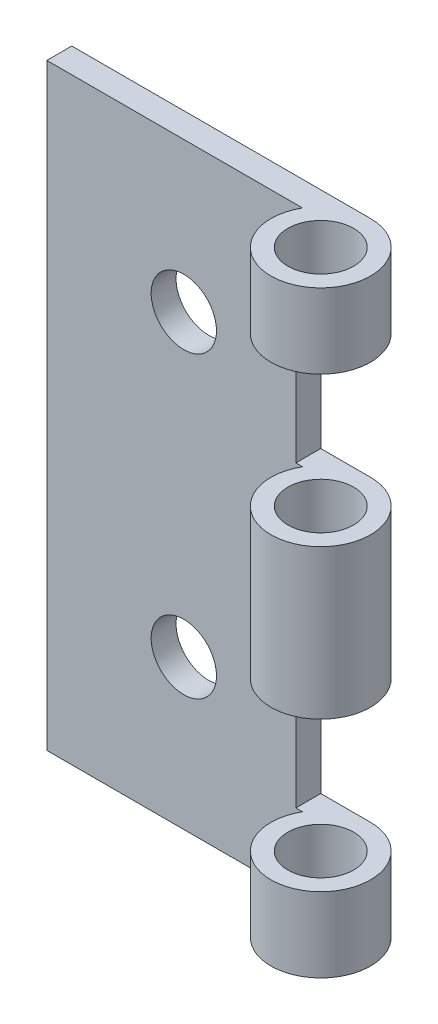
from build123d import *

# Parameters (mm, degrees)
SKETCH1_W               = 38.1
SKETCH1_H               = 76.2
BASE_EXTRUDE_DEPTH      = 3.175
SKETCH2_R               = 4.1656
CUT_EXTRUDE1_DEPTH      = 86.253332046
SKETCH3_R               = 4.1656
CUT_EXTRUDE2_DEPTH      = 86.253332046
SKETCH4_R               = 6.35
BOSS_EXTRUDE1_DEPTH     = 76.2
SKETCH5_R               = 4.191
CUT_EXTRUDE3_DEPTH      = 76.2
CUT_EXTRUDE4_DEPTH      = 86.725
CUT_EXTRUDE4_DEPTH_BACK = 86.725
CUT_EXTRUDE5_DEPTH      = 86.725
CUT_EXTRUDE5_DEPTH_BACK = 86.725


with BuildPart() as part:
    # Sketch1 → Base-Extrude (new body)
    with BuildSketch(Plane.XY):
        with Locations((-19.05, 38.1)):
            Rectangle(SKETCH1_W, SKETCH1_H)
    extrude(amount=-BASE_EXTRUDE_DEPTH)

    # Sketch2 → Cut-Extrude1 (cut, through all)
    with BuildSketch(Plane.XY):
        with Locations((-20.6375, 57.15)):
            Circle(SKETCH2_R)
    extrude(amount=-CUT_EXTRUDE1_DEPTH, mode=Mode.SUBTRACT)

    # Sketch3 → Cut-Extrude2 (cut, through all)
    with BuildSketch(Plane.XY):
        with Locations((-20.6375, 19.05)):
            Circle(SKETCH3_R)
    extrude(amount=-CUT_EXTRUDE2_DEPTH, mode=Mode.SUBTRACT)

    # Sketch4 → Boss-Extrude1 (add)
    with BuildSketch(Plane.XZ):
        with Locations((0, 3.175)):
            Circle(SKETCH4_R)
    extrude(amount=-BOSS_EXTRUDE1_DEPTH)

    # Sketch5 → Cut-Extrude3 (cut)
    with BuildSketch(Plane.XZ):
        with Locations((0, 3.175)):
            Circle(SKETCH5_R)
    extrude(amount=-CUT_EXTRUDE3_DEPTH, mode=Mode.SUBTRACT)

    # Sketch6 → Cut-Extrude4 (cut, two sides: drawn at the far end of the back side and taken through both)
    with BuildSketch(Plane.XY.offset(-CUT_EXTRUDE4_DEPTH_BACK)):
        Polygon((180.274363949, 66.675), (8.071956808, 66.675), (-6.35, 66.675), (-6.35, 47.625), (8.071956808, 47.625), (180.274363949, 47.625), (524.679178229, 47.625), (524.679178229, 66.675), align=None)
    extrude(amount=CUT_EXTRUDE4_DEPTH + CUT_EXTRUDE4_DEPTH_BACK, mode=Mode.SUBTRACT)

    # Sketch7 → Cut-Extrude5 (cut, two sides: drawn at the far end of the back side and taken through both)
    with BuildSketch(Plane.XY.offset(-CUT_EXTRUDE5_DEPTH_BACK)):
        Polygon((186.501879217, 28.575), (10.952200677, 28.575), (-6.35, 28.575), (-6.35, 9.525), (10.952200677, 9.525), (186.501879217, 9.525), (537.601236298, 9.525), (537.601236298, 28.575), align=None)
    extrude(amount=CUT_EXTRUDE5_DEPTH + CUT_EXTRUDE5_DEPTH_BACK, mode=Mode.SUBTRACT)


solid = part.part
